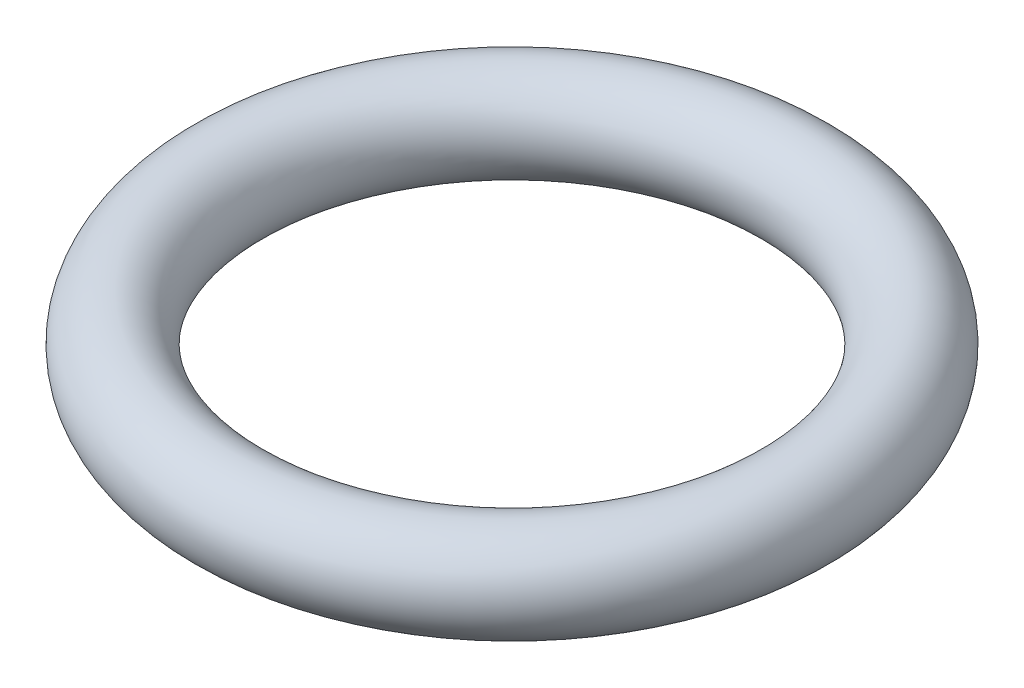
from build123d import *

# Parameters (mm, degrees)
ESQUISSE1_R = 1


with BuildPart() as part:
    # Esquisse1 → R_volution1 (revolve)
    with BuildSketch(Plane.XY, mode=Mode.PRIVATE) as r_volution1_sk:
        with Locations((-6, 0)):
            Circle(ESQUISSE1_R)
    revolve(r_volution1_sk.sketch.rotate(Axis((0, 0, 0), (0, 1, 0)), 270), axis=Axis((0, 0, 0), (0, 1, 0)))


solid = part.part
